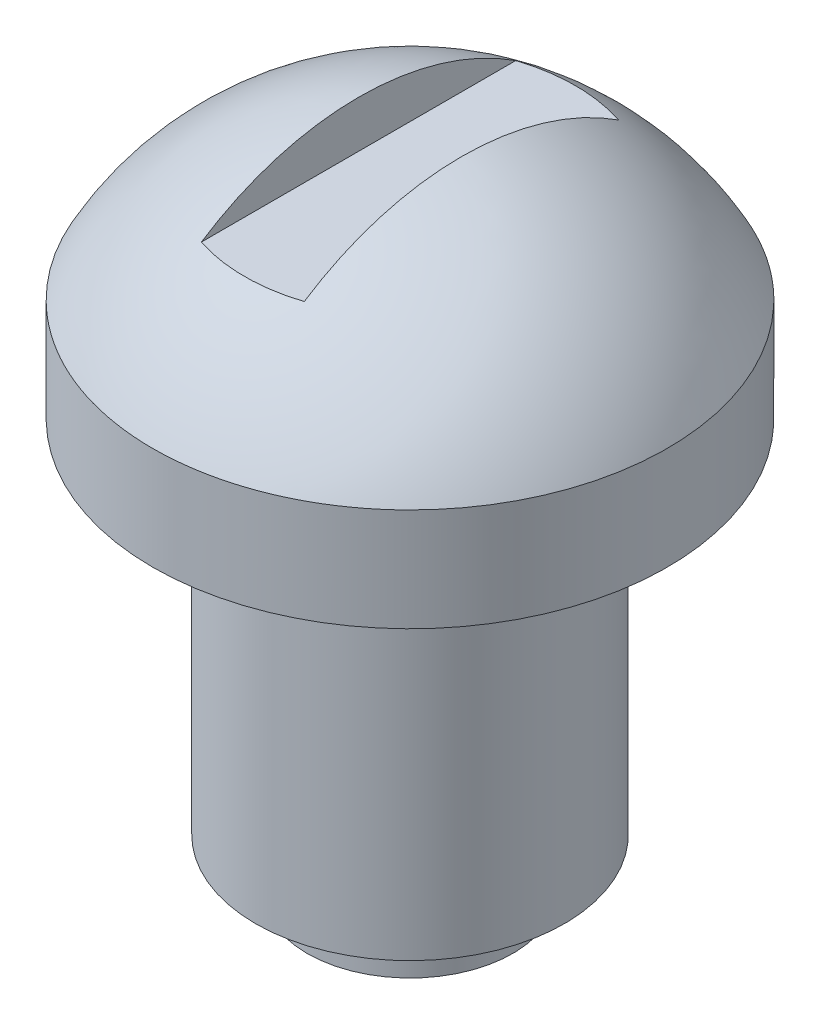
ISO-10303-21;
HEADER;
FILE_DESCRIPTION(('STEP AP214'),'2;1');
FILE_NAME('part.step','',(''),(''),'','','');
FILE_SCHEMA(('AUTOMOTIVE_DESIGN { 1 0 10303 214 1 1 1 1 }'));
ENDSEC;
DATA;
#1=APPLICATION_CONTEXT('core data for automotive mechanical design processes');
#2=APPLICATION_PROTOCOL_DEFINITION('international standard','automotive_design',2000,#1);
#3=PRODUCT_CONTEXT('',#1,'mechanical');
#4=PRODUCT('Part','Part','',(#3));
#5=PRODUCT_RELATED_PRODUCT_CATEGORY('part','',(#4));
#6=PRODUCT_DEFINITION_FORMATION('','',#4);
#7=PRODUCT_DEFINITION_CONTEXT('part definition',#1,'design');
#8=PRODUCT_DEFINITION('design','',#6,#7);
#9=PRODUCT_DEFINITION_SHAPE('','',#8);
#10=(LENGTH_UNIT() NAMED_UNIT(*) SI_UNIT(.MILLI.,.METRE.));
#11=(NAMED_UNIT(*) PLANE_ANGLE_UNIT() SI_UNIT($,.RADIAN.));
#12=(NAMED_UNIT(*) SI_UNIT($,.STERADIAN.) SOLID_ANGLE_UNIT());
#13=UNCERTAINTY_MEASURE_WITH_UNIT(LENGTH_MEASURE(1.E-05),#10,'distance_accuracy_value','');
#14=(GEOMETRIC_REPRESENTATION_CONTEXT(3) GLOBAL_UNCERTAINTY_ASSIGNED_CONTEXT((#13)) GLOBAL_UNIT_ASSIGNED_CONTEXT((#10,
#11,#12)) REPRESENTATION_CONTEXT('',''));
#15=CARTESIAN_POINT('',(0.,0.,0.));
#16=DIRECTION('',(0.,0.,1.));
#17=DIRECTION('',(1.,0.,0.));
#18=AXIS2_PLACEMENT_3D('',#15,#16,#17);
#19=CARTESIAN_POINT('',(0.,0.,0.));
#20=DIRECTION('',(0.,1.,0.));
#21=DIRECTION('',(0.,0.,1.));
#22=AXIS2_PLACEMENT_3D('',#19,#20,#21);
#23=PLANE('',#22);
#24=CARTESIAN_POINT('',(0.,0.,0.));
#25=DIRECTION('',(0.,1.,0.));
#26=DIRECTION('',(0.,0.,1.));
#27=AXIS2_PLACEMENT_3D('',#24,#25,#26);
#28=CIRCLE('',#27,2.);
#29=CARTESIAN_POINT('',(0.,0.,2.));
#30=VERTEX_POINT('',#29);
#31=EDGE_CURVE('E66',#30,#30,#28,.T.);
#32=ORIENTED_EDGE('',*,*,#31,.F.);
#33=EDGE_LOOP('',(#32));
#34=FACE_BOUND('',#33,.T.);
#35=ADVANCED_FACE('F34',(#34),#23,.F.);
#36=CARTESIAN_POINT('',(0.,0.,0.));
#37=DIRECTION('',(0.,1.,0.));
#38=DIRECTION('',(0.,0.,1.));
#39=AXIS2_PLACEMENT_3D('',#36,#37,#38);
#40=CYLINDRICAL_SURFACE('',#39,2.);
#41=CARTESIAN_POINT('',(0.,1.,0.));
#42=DIRECTION('',(0.,1.,0.));
#43=DIRECTION('',(0.,0.,1.));
#44=AXIS2_PLACEMENT_3D('',#41,#42,#43);
#45=CIRCLE('',#44,2.);
#46=CARTESIAN_POINT('',(0.,1.,2.));
#47=VERTEX_POINT('',#46);
#48=EDGE_CURVE('E79',#47,#47,#45,.T.);
#49=ORIENTED_EDGE('',*,*,#48,.F.);
#50=EDGE_LOOP('',(#49));
#51=FACE_BOUND('',#50,.T.);
#52=ORIENTED_EDGE('',*,*,#31,.T.);
#53=EDGE_LOOP('',(#52));
#54=FACE_BOUND('',#53,.T.);
#55=ADVANCED_FACE('F103',(#51,#54),#40,.T.);
#56=CARTESIAN_POINT('',(2.,1.,0.));
#57=DIRECTION('',(0.,1.,0.));
#58=DIRECTION('',(0.,0.,1.));
#59=AXIS2_PLACEMENT_3D('',#56,#57,#58);
#60=PLANE('',#59);
#61=CARTESIAN_POINT('',(0.,1.,0.));
#62=DIRECTION('',(0.,1.,0.));
#63=DIRECTION('',(0.,0.,1.));
#64=AXIS2_PLACEMENT_3D('',#61,#62,#63);
#65=CIRCLE('',#64,3.);
#66=CARTESIAN_POINT('',(0.,1.,3.));
#67=VERTEX_POINT('',#66);
#68=EDGE_CURVE('E82',#67,#67,#65,.T.);
#69=ORIENTED_EDGE('',*,*,#68,.F.);
#70=EDGE_LOOP('',(#69));
#71=FACE_BOUND('',#70,.T.);
#72=ORIENTED_EDGE('',*,*,#48,.T.);
#73=EDGE_LOOP('',(#72));
#74=FACE_BOUND('',#73,.T.);
#75=ADVANCED_FACE('F108',(#71,#74),#60,.F.);
#76=CARTESIAN_POINT('',(0.,0.,0.));
#77=DIRECTION('',(0.,1.,0.));
#78=DIRECTION('',(0.,0.,1.));
#79=AXIS2_PLACEMENT_3D('',#76,#77,#78);
#80=CYLINDRICAL_SURFACE('',#79,3.);
#81=CARTESIAN_POINT('',(0.,8.00000000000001,0.));
#82=DIRECTION('',(0.,1.,0.));
#83=DIRECTION('',(0.,0.,1.));
#84=AXIS2_PLACEMENT_3D('',#81,#82,#83);
#85=CIRCLE('',#84,3.);
#86=CARTESIAN_POINT('',(0.,8.00000000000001,3.));
#87=VERTEX_POINT('',#86);
#88=EDGE_CURVE('E85',#87,#87,#85,.T.);
#89=ORIENTED_EDGE('',*,*,#88,.F.);
#90=EDGE_LOOP('',(#89));
#91=FACE_BOUND('',#90,.T.);
#92=ORIENTED_EDGE('',*,*,#68,.T.);
#93=EDGE_LOOP('',(#92));
#94=FACE_BOUND('',#93,.T.);
#95=ADVANCED_FACE('F115',(#91,#94),#80,.T.);
#96=CARTESIAN_POINT('',(2.99999999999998,8.00000000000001,0.));
#97=DIRECTION('',(0.,1.,0.));
#98=DIRECTION('',(0.,0.,1.));
#99=AXIS2_PLACEMENT_3D('',#96,#97,#98);
#100=PLANE('',#99);
#101=CARTESIAN_POINT('',(0.,8.00000000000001,0.));
#102=DIRECTION('',(0.,1.,0.));
#103=DIRECTION('',(0.,0.,1.));
#104=AXIS2_PLACEMENT_3D('',#101,#102,#103);
#105=CIRCLE('',#104,5.);
#106=CARTESIAN_POINT('',(0.,8.00000000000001,5.));
#107=VERTEX_POINT('',#106);
#108=EDGE_CURVE('E76',#107,#107,#105,.T.);
#109=ORIENTED_EDGE('',*,*,#108,.F.);
#110=EDGE_LOOP('',(#109));
#111=FACE_BOUND('',#110,.T.);
#112=ORIENTED_EDGE('',*,*,#88,.T.);
#113=EDGE_LOOP('',(#112));
#114=FACE_BOUND('',#113,.T.);
#115=ADVANCED_FACE('F119',(#111,#114),#100,.F.);
#116=CARTESIAN_POINT('',(0.,0.,0.));
#117=DIRECTION('',(0.,1.,0.));
#118=DIRECTION('',(0.,0.,1.));
#119=AXIS2_PLACEMENT_3D('',#116,#117,#118);
#120=CYLINDRICAL_SURFACE('',#119,5.);
#121=CARTESIAN_POINT('',(0.,10.,0.));
#122=DIRECTION('',(0.,1.,0.));
#123=DIRECTION('',(0.,0.,1.));
#124=AXIS2_PLACEMENT_3D('',#121,#122,#123);
#125=CIRCLE('',#124,5.);
#126=CARTESIAN_POINT('',(0.,10.,5.));
#127=VERTEX_POINT('',#126);
#128=EDGE_CURVE('E73',#127,#127,#125,.T.);
#129=ORIENTED_EDGE('',*,*,#128,.F.);
#130=EDGE_LOOP('',(#129));
#131=FACE_BOUND('',#130,.T.);
#132=ORIENTED_EDGE('',*,*,#108,.T.);
#133=EDGE_LOOP('',(#132));
#134=FACE_BOUND('',#133,.T.);
#135=ADVANCED_FACE('F99',(#131,#134),#120,.T.);
#136=CARTESIAN_POINT('',(0.,7.33333333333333,0.));
#137=DIRECTION('',(0.,0.,1.));
#138=DIRECTION('',(1.,0.,0.));
#139=AXIS2_PLACEMENT_3D('',#136,#137,#138);
#140=SPHERICAL_SURFACE('',#139,5.66666666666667);
#141=CARTESIAN_POINT('',(0.,12.,0.));
#142=DIRECTION('',(0.,-1.,0.));
#143=DIRECTION('',(0.,0.,-1.));
#144=AXIS2_PLACEMENT_3D('',#141,#142,#143);
#145=CIRCLE('',#144,3.21455025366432);
#146=CARTESIAN_POINT('',(-1.,12.,-3.0550504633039));
#147=VERTEX_POINT('',#146);
#148=CARTESIAN_POINT('',(1.,12.,-3.0550504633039));
#149=VERTEX_POINT('',#148);
#150=EDGE_CURVE('E65',#147,#149,#145,.T.);
#151=ORIENTED_EDGE('',*,*,#150,.T.);
#152=CARTESIAN_POINT('',(1.,7.33333333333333,0.));
#153=DIRECTION('',(1.,0.,0.));
#154=DIRECTION('',(0.,1.,0.));
#155=AXIS2_PLACEMENT_3D('',#152,#153,#154);
#156=CIRCLE('',#155,5.57773351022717);
#157=CARTESIAN_POINT('',(1.,12.,3.0550504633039));
#158=VERTEX_POINT('',#157);
#159=EDGE_CURVE('E11',#149,#158,#156,.T.);
#160=ORIENTED_EDGE('',*,*,#159,.T.);
#161=CARTESIAN_POINT('',(-1.,12.,3.0550504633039));
#162=VERTEX_POINT('',#161);
#163=EDGE_CURVE('E42',#158,#162,#145,.T.);
#164=ORIENTED_EDGE('',*,*,#163,.T.);
#165=CARTESIAN_POINT('',(-1.,7.33333333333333,0.));
#166=DIRECTION('',(-1.,0.,0.));
#167=DIRECTION('',(0.,-1.,0.));
#168=AXIS2_PLACEMENT_3D('',#165,#166,#167);
#169=CIRCLE('',#168,5.57773351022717);
#170=EDGE_CURVE('E61',#162,#147,#169,.T.);
#171=ORIENTED_EDGE('',*,*,#170,.T.);
#172=EDGE_LOOP('',(#151,#160,#164,#171));
#173=FACE_BOUND('',#172,.T.);
#174=ORIENTED_EDGE('',*,*,#128,.T.);
#175=EDGE_LOOP('',(#174));
#176=FACE_BOUND('',#175,.T.);
#177=ADVANCED_FACE('F36',(#173,#176),#140,.T.);
#178=CARTESIAN_POINT('',(1.,14.,-4.99999999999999));
#179=DIRECTION('',(1.,0.,0.));
#180=DIRECTION('',(0.,1.,0.));
#181=AXIS2_PLACEMENT_3D('',#178,#179,#180);
#182=PLANE('',#181);
#183=DIRECTION('',(0.,0.,1.));
#184=VECTOR('',#183,1.);
#185=CARTESIAN_POINT('',(1.,12.,-4.99999999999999));
#186=LINE('',#185,#184);
#187=EDGE_CURVE('E69',#149,#158,#186,.T.);
#188=ORIENTED_EDGE('',*,*,#187,.T.);
#189=ORIENTED_EDGE('',*,*,#159,.F.);
#190=EDGE_LOOP('',(#188,#189));
#191=FACE_BOUND('',#190,.T.);
#192=ADVANCED_FACE('F91',(#191),#182,.F.);
#193=CARTESIAN_POINT('',(-1.,12.,-5.));
#194=DIRECTION('',(0.,-1.,0.));
#195=DIRECTION('',(0.,0.,-1.));
#196=AXIS2_PLACEMENT_3D('',#193,#194,#195);
#197=PLANE('',#196);
#198=ORIENTED_EDGE('',*,*,#187,.F.);
#199=ORIENTED_EDGE('',*,*,#150,.F.);
#200=DIRECTION('',(0.,0.,1.));
#201=VECTOR('',#200,1.);
#202=CARTESIAN_POINT('',(-1.,12.,-5.));
#203=LINE('',#202,#201);
#204=EDGE_CURVE('E48',#147,#162,#203,.T.);
#205=ORIENTED_EDGE('',*,*,#204,.T.);
#206=ORIENTED_EDGE('',*,*,#163,.F.);
#207=EDGE_LOOP('',(#198,#199,#205,#206));
#208=FACE_BOUND('',#207,.T.);
#209=ADVANCED_FACE('F68',(#208),#197,.F.);
#210=CARTESIAN_POINT('',(-1.,14.,-5.));
#211=DIRECTION('',(-1.,0.,0.));
#212=DIRECTION('',(0.,-1.,0.));
#213=AXIS2_PLACEMENT_3D('',#210,#211,#212);
#214=PLANE('',#213);
#215=ORIENTED_EDGE('',*,*,#204,.F.);
#216=ORIENTED_EDGE('',*,*,#170,.F.);
#217=EDGE_LOOP('',(#215,#216));
#218=FACE_BOUND('',#217,.T.);
#219=ADVANCED_FACE('F62',(#218),#214,.F.);
#220=CLOSED_SHELL('',(#35,#55,#75,#95,#115,#135,#177,#192,#209,#219));
#221=MANIFOLD_SOLID_BREP('B2',#220);
#222=ADVANCED_BREP_SHAPE_REPRESENTATION('',(#18,#221),#14);
#223=SHAPE_DEFINITION_REPRESENTATION(#9,#222);
ENDSEC;
END-ISO-10303-21;
